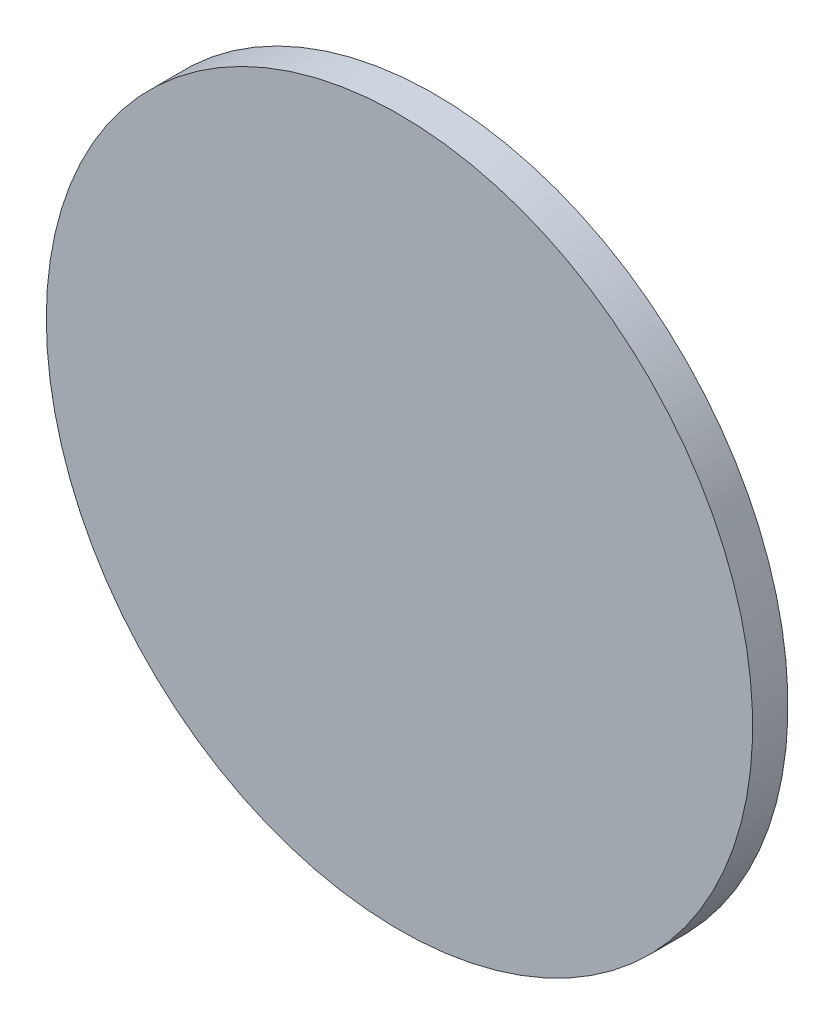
ISO-10303-21;
HEADER;
FILE_DESCRIPTION(('STEP AP214'),'2;1');
FILE_NAME('part.step','',(''),(''),'','','');
FILE_SCHEMA(('AUTOMOTIVE_DESIGN { 1 0 10303 214 1 1 1 1 }'));
ENDSEC;
DATA;
#1=APPLICATION_CONTEXT('core data for automotive mechanical design processes');
#2=APPLICATION_PROTOCOL_DEFINITION('international standard','automotive_design',2000,#1);
#3=PRODUCT_CONTEXT('',#1,'mechanical');
#4=PRODUCT('Part','Part','',(#3));
#5=PRODUCT_RELATED_PRODUCT_CATEGORY('part','',(#4));
#6=PRODUCT_DEFINITION_FORMATION('','',#4);
#7=PRODUCT_DEFINITION_CONTEXT('part definition',#1,'design');
#8=PRODUCT_DEFINITION('design','',#6,#7);
#9=PRODUCT_DEFINITION_SHAPE('','',#8);
#10=(LENGTH_UNIT() NAMED_UNIT(*) SI_UNIT(.MILLI.,.METRE.));
#11=(NAMED_UNIT(*) PLANE_ANGLE_UNIT() SI_UNIT($,.RADIAN.));
#12=(NAMED_UNIT(*) SI_UNIT($,.STERADIAN.) SOLID_ANGLE_UNIT());
#13=UNCERTAINTY_MEASURE_WITH_UNIT(LENGTH_MEASURE(1.E-05),#10,'distance_accuracy_value','');
#14=(GEOMETRIC_REPRESENTATION_CONTEXT(3) GLOBAL_UNCERTAINTY_ASSIGNED_CONTEXT((#13)) GLOBAL_UNIT_ASSIGNED_CONTEXT((#10,
#11,#12)) REPRESENTATION_CONTEXT('',''));
#15=CARTESIAN_POINT('',(0.,0.,0.));
#16=DIRECTION('',(0.,0.,1.));
#17=DIRECTION('',(1.,0.,0.));
#18=AXIS2_PLACEMENT_3D('',#15,#16,#17);
#19=CARTESIAN_POINT('',(640.,-109.,-70.9));
#20=DIRECTION('',(-1.,0.,0.));
#21=DIRECTION('',(0.,0.,1.));
#22=AXIS2_PLACEMENT_3D('',#19,#20,#21);
#23=PLANE('',#22);
#24=DIRECTION('',(0.,0.,1.));
#25=VECTOR('',#24,1.);
#26=CARTESIAN_POINT('',(640.,-108.,-70.9));
#27=LINE('',#26,#25);
#28=CARTESIAN_POINT('',(640.,-108.,-68.9));
#29=VERTEX_POINT('',#28);
#30=CARTESIAN_POINT('',(640.,-108.,-70.4673638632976));
#31=VERTEX_POINT('',#30);
#32=EDGE_CURVE('E68',#29,#31,#27,.F.);
#33=ORIENTED_EDGE('',*,*,#32,.T.);
#34=CARTESIAN_POINT('',(640.,-108.,-70.4673638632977));
#35=CARTESIAN_POINT('',(640.,-108.333333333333,-70.4872656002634));
#36=CARTESIAN_POINT('',(640.,-108.666666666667,-70.4972164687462));
#37=CARTESIAN_POINT('',(640.,-109.333333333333,-70.4972164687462));
#38=CARTESIAN_POINT('',(640.,-109.666666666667,-70.4872656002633));
#39=CARTESIAN_POINT('',(640.,-110.,-70.4673638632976));
#40=B_SPLINE_CURVE_WITH_KNOTS('',3,(#34,#35,#36,#37,#38,#39),.UNSPECIFIED.,.F.,.F.,(4,2,4),(0.,
1.00044548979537,2.00089097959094),.UNSPECIFIED.);
#41=CARTESIAN_POINT('',(640.,-110.,-70.4673638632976));
#42=VERTEX_POINT('',#41);
#43=EDGE_CURVE('E60',#31,#42,#40,.T.);
#44=ORIENTED_EDGE('',*,*,#43,.T.);
#45=DIRECTION('',(0.,0.,1.));
#46=VECTOR('',#45,1.);
#47=CARTESIAN_POINT('',(640.,-110.,-70.9));
#48=LINE('',#47,#46);
#49=CARTESIAN_POINT('',(640.,-110.,-68.9));
#50=VERTEX_POINT('',#49);
#51=EDGE_CURVE('E66',#42,#50,#48,.T.);
#52=ORIENTED_EDGE('',*,*,#51,.T.);
#53=DIRECTION('',(0.,1.,0.));
#54=VECTOR('',#53,1.);
#55=CARTESIAN_POINT('',(640.,-109.,-68.9));
#56=LINE('',#55,#54);
#57=EDGE_CURVE('E137',#29,#50,#56,.F.);
#58=ORIENTED_EDGE('',*,*,#57,.F.);
#59=EDGE_LOOP('',(#33,#44,#52,#58));
#60=FACE_BOUND('',#59,.T.);
#61=ADVANCED_FACE('F16',(#60),#23,.T.);
#62=CARTESIAN_POINT('',(626.,-109.,-70.9));
#63=DIRECTION('',(1.,0.,0.));
#64=DIRECTION('',(0.,0.,-1.));
#65=AXIS2_PLACEMENT_3D('',#62,#63,#64);
#66=PLANE('',#65);
#67=DIRECTION('',(0.,0.,-1.));
#68=VECTOR('',#67,1.);
#69=CARTESIAN_POINT('',(626.,-110.,-70.8999999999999));
#70=LINE('',#69,#68);
#71=CARTESIAN_POINT('',(626.,-110.,-68.9));
#72=VERTEX_POINT('',#71);
#73=CARTESIAN_POINT('',(626.,-110.,-70.4673638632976));
#74=VERTEX_POINT('',#73);
#75=EDGE_CURVE('E150',#72,#74,#70,.T.);
#76=ORIENTED_EDGE('',*,*,#75,.T.);
#77=CARTESIAN_POINT('',(626.,-110.,-70.4673638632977));
#78=CARTESIAN_POINT('',(626.,-109.666666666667,-70.4872656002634));
#79=CARTESIAN_POINT('',(626.,-109.333333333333,-70.4972164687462));
#80=CARTESIAN_POINT('',(626.,-108.666666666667,-70.4972164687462));
#81=CARTESIAN_POINT('',(626.,-108.333333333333,-70.4872656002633));
#82=CARTESIAN_POINT('',(626.,-108.,-70.4673638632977));
#83=B_SPLINE_CURVE_WITH_KNOTS('',3,(#77,#78,#79,#80,#81,#82),.UNSPECIFIED.,.F.,.F.,(4,2,4),(0.,
1.00044548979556,2.00089097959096),.UNSPECIFIED.);
#84=CARTESIAN_POINT('',(626.,-108.,-70.4673638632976));
#85=VERTEX_POINT('',#84);
#86=EDGE_CURVE('E81',#74,#85,#83,.T.);
#87=ORIENTED_EDGE('',*,*,#86,.T.);
#88=DIRECTION('',(0.,0.,-1.));
#89=VECTOR('',#88,1.);
#90=CARTESIAN_POINT('',(626.,-108.,-70.9));
#91=LINE('',#90,#89);
#92=CARTESIAN_POINT('',(626.,-108.,-68.8999999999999));
#93=VERTEX_POINT('',#92);
#94=EDGE_CURVE('E40',#85,#93,#91,.F.);
#95=ORIENTED_EDGE('',*,*,#94,.T.);
#96=DIRECTION('',(0.,1.,0.));
#97=VECTOR('',#96,1.);
#98=CARTESIAN_POINT('',(626.,-109.,-68.9));
#99=LINE('',#98,#97);
#100=EDGE_CURVE('E135',#72,#93,#99,.T.);
#101=ORIENTED_EDGE('',*,*,#100,.F.);
#102=EDGE_LOOP('',(#76,#87,#95,#101));
#103=FACE_BOUND('',#102,.T.);
#104=ADVANCED_FACE('F161',(#103),#66,.T.);
#105=CARTESIAN_POINT('',(633.,-109.,-68.9));
#106=DIRECTION('',(0.,0.,-1.));
#107=DIRECTION('',(-1.,0.,0.));
#108=AXIS2_PLACEMENT_3D('',#105,#106,#107);
#109=PLANE('',#108);
#110=ORIENTED_EDGE('',*,*,#100,.T.);
#111=DIRECTION('',(1.,0.,0.));
#112=VECTOR('',#111,1.);
#113=CARTESIAN_POINT('',(633.,-108.,-68.9));
#114=LINE('',#113,#112);
#115=EDGE_CURVE('E83',#29,#93,#114,.F.);
#116=ORIENTED_EDGE('',*,*,#115,.F.);
#117=ORIENTED_EDGE('',*,*,#57,.T.);
#118=DIRECTION('',(1.,0.,0.));
#119=VECTOR('',#118,1.);
#120=CARTESIAN_POINT('',(633.,-110.,-68.9));
#121=LINE('',#120,#119);
#122=EDGE_CURVE('E77',#72,#50,#121,.T.);
#123=ORIENTED_EDGE('',*,*,#122,.F.);
#124=EDGE_LOOP('',(#110,#116,#117,#123));
#125=FACE_BOUND('',#124,.T.);
#126=ADVANCED_FACE('F106',(#125),#109,.T.);
#127=CARTESIAN_POINT('',(633.,-110.,-70.9));
#128=DIRECTION('',(0.,1.,0.));
#129=DIRECTION('',(0.,0.,1.));
#130=AXIS2_PLACEMENT_3D('',#127,#128,#129);
#131=PLANE('',#130);
#132=ORIENTED_EDGE('',*,*,#122,.T.);
#133=ORIENTED_EDGE('',*,*,#51,.F.);
#134=CARTESIAN_POINT('',(626.,-110.,-70.4673638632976));
#135=CARTESIAN_POINT('',(626.313545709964,-110.,-70.598534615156));
#136=CARTESIAN_POINT('',(626.630784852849,-110.,-70.72087279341));
#137=CARTESIAN_POINT('',(627.27162720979,-110.,-70.9475405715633));
#138=CARTESIAN_POINT('',(627.595230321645,-110.,-71.0518704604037));
#139=CARTESIAN_POINT('',(628.247787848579,-110.,-71.2421824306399));
#140=CARTESIAN_POINT('',(628.576742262,-110.,-71.3281645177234));
#141=CARTESIAN_POINT('',(629.239174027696,-110.,-71.4815620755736));
#142=CARTESIAN_POINT('',(629.572654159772,-110.,-71.5489655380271));
#143=CARTESIAN_POINT('',(630.24287303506,-110.,-71.6649165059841));
#144=CARTESIAN_POINT('',(630.579611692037,-110.,-71.713464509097));
#145=CARTESIAN_POINT('',(631.255251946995,-110.,-71.7915532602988));
#146=CARTESIAN_POINT('',(631.594153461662,-110.,-71.821094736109));
#147=CARTESIAN_POINT('',(632.443158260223,-110.,-71.8710862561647));
#148=CARTESIAN_POINT('',(632.954014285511,-110.,-71.8795769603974));
#149=CARTESIAN_POINT('',(633.974645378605,-110.,-71.8534474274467));
#150=CARTESIAN_POINT('',(634.484420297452,-110.,-71.8188215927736));
#151=CARTESIAN_POINT('',(635.498320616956,-110.,-71.7068091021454));
#152=CARTESIAN_POINT('',(636.002454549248,-110.,-71.6294996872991));
#153=CARTESIAN_POINT('',(637.002225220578,-110.,-71.4327505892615));
#154=CARTESIAN_POINT('',(637.497865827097,-110.,-71.3133306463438));
#155=CARTESIAN_POINT('',(638.329727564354,-110.,-71.0754351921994));
#156=CARTESIAN_POINT('',(638.669004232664,-110.,-70.9675073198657));
#157=CARTESIAN_POINT('',(639.340182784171,-110.,-70.7320461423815));
#158=CARTESIAN_POINT('',(639.672093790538,-110.,-70.604538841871));
#159=CARTESIAN_POINT('',(640.,-110.,-70.4673638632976));
#160=B_SPLINE_CURVE_WITH_KNOTS('',3,(#134,#135,#136,#137,#138,#139,#140,#141,#142,#143,#144,
#145,#146,#147,#148,#149,#150,#151,#152,#153,#154,#155,#156,#157,#158,#159),.UNSPECIFIED.,.F.,
.F.,(4,2,2,2,2,2,2,2,2,2,2,2,4),(0.,1.01949601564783,2.03897567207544,3.05845501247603,
4.07859175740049,5.09870157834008,6.11877233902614,7.64962412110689,9.18067466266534,
10.7089636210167,12.2365371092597,13.3040452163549,14.3701475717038),.UNSPECIFIED.);
#161=EDGE_CURVE('E74',#74,#42,#160,.T.);
#162=ORIENTED_EDGE('',*,*,#161,.F.);
#163=ORIENTED_EDGE('',*,*,#75,.F.);
#164=EDGE_LOOP('',(#132,#133,#162,#163));
#165=FACE_BOUND('',#164,.T.);
#166=ADVANCED_FACE('F72',(#165),#131,.T.);
#167=CARTESIAN_POINT('',(633.,-108.,-70.9));
#168=DIRECTION('',(0.,-1.,0.));
#169=DIRECTION('',(0.,0.,-1.));
#170=AXIS2_PLACEMENT_3D('',#167,#168,#169);
#171=PLANE('',#170);
#172=ORIENTED_EDGE('',*,*,#115,.T.);
#173=ORIENTED_EDGE('',*,*,#94,.F.);
#174=CARTESIAN_POINT('',(640.,-108.,-70.4673638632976));
#175=CARTESIAN_POINT('',(639.686454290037,-108.,-70.5985346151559));
#176=CARTESIAN_POINT('',(639.369215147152,-108.,-70.7208727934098));
#177=CARTESIAN_POINT('',(638.72837279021,-108.,-70.9475405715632));
#178=CARTESIAN_POINT('',(638.404769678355,-108.,-71.0518704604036));
#179=CARTESIAN_POINT('',(637.752212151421,-108.,-71.2421824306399));
#180=CARTESIAN_POINT('',(637.423257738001,-108.,-71.3281645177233));
#181=CARTESIAN_POINT('',(636.760825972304,-108.,-71.4815620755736));
#182=CARTESIAN_POINT('',(636.427345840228,-108.,-71.5489655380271));
#183=CARTESIAN_POINT('',(635.75712696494,-108.,-71.6649165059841));
#184=CARTESIAN_POINT('',(635.420388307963,-108.,-71.7134645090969));
#185=CARTESIAN_POINT('',(634.744748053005,-108.,-71.7915532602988));
#186=CARTESIAN_POINT('',(634.405846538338,-108.,-71.8210947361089));
#187=CARTESIAN_POINT('',(633.556841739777,-108.,-71.8710862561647));
#188=CARTESIAN_POINT('',(633.045985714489,-108.,-71.8795769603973));
#189=CARTESIAN_POINT('',(632.025354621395,-108.,-71.8534474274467));
#190=CARTESIAN_POINT('',(631.515579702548,-108.,-71.8188215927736));
#191=CARTESIAN_POINT('',(630.501679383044,-108.,-71.7068091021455));
#192=CARTESIAN_POINT('',(629.997545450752,-108.,-71.6294996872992));
#193=CARTESIAN_POINT('',(628.997774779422,-108.,-71.4327505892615));
#194=CARTESIAN_POINT('',(628.502134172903,-108.,-71.3133306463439));
#195=CARTESIAN_POINT('',(627.670272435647,-108.,-71.0754351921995));
#196=CARTESIAN_POINT('',(627.330995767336,-108.,-70.9675073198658));
#197=CARTESIAN_POINT('',(626.659817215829,-108.,-70.7320461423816));
#198=CARTESIAN_POINT('',(626.327906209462,-108.,-70.6045388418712));
#199=CARTESIAN_POINT('',(626.,-108.,-70.4673638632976));
#200=B_SPLINE_CURVE_WITH_KNOTS('',3,(#174,#175,#176,#177,#178,#179,#180,#181,#182,#183,#184,
#185,#186,#187,#188,#189,#190,#191,#192,#193,#194,#195,#196,#197,#198,#199),.UNSPECIFIED.,.F.,
.F.,(4,2,2,2,2,2,2,2,2,2,2,2,4),(0.,1.01949601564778,2.03897567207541,3.05845501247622,
4.0785917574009,5.09870157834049,6.11877233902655,7.6496241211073,9.18067466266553,
10.7089636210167,12.2365371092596,13.304045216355,14.3701475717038),.UNSPECIFIED.);
#201=EDGE_CURVE('E82',#31,#85,#200,.T.);
#202=ORIENTED_EDGE('',*,*,#201,.F.);
#203=ORIENTED_EDGE('',*,*,#32,.F.);
#204=EDGE_LOOP('',(#172,#173,#202,#203));
#205=FACE_BOUND('',#204,.T.);
#206=ADVANCED_FACE('F105',(#205),#171,.T.);
#207=CARTESIAN_POINT('',(633.,-109.,-53.7333333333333));
#208=DIRECTION('',(0.192522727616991,0.731996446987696,0.65354127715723));
#209=DIRECTION('',(0.334221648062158,-0.675094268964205,0.657680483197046));
#210=AXIS2_PLACEMENT_3D('',#207,#208,#209);
#211=SPHERICAL_SURFACE('',#210,18.1666666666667);
#212=ORIENTED_EDGE('',*,*,#161,.T.);
#213=ORIENTED_EDGE('',*,*,#43,.F.);
#214=ORIENTED_EDGE('',*,*,#201,.T.);
#215=ORIENTED_EDGE('',*,*,#86,.F.);
#216=EDGE_LOOP('',(#212,#213,#214,#215));
#217=FACE_BOUND('',#216,.T.);
#218=CARTESIAN_POINT('',(633.,-109.,-68.9));
#219=DIRECTION('',(0.,0.,-1.));
#220=DIRECTION('',(-1.,0.,0.));
#221=AXIS2_PLACEMENT_3D('',#218,#219,#220);
#222=CIRCLE('',#221,10.);
#223=CARTESIAN_POINT('',(623.,-109.,-68.9));
#224=VERTEX_POINT('',#223);
#225=EDGE_CURVE('E31',#224,#224,#222,.F.);
#226=ORIENTED_EDGE('',*,*,#225,.F.);
#227=EDGE_LOOP('',(#226));
#228=FACE_BOUND('',#227,.T.);
#229=ADVANCED_FACE('F79',(#217,#228),#211,.T.);
#230=CARTESIAN_POINT('',(633.,-109.,-68.4));
#231=DIRECTION('',(0.,0.,-1.));
#232=DIRECTION('',(-1.,0.,0.));
#233=AXIS2_PLACEMENT_3D('',#230,#231,#232);
#234=CYLINDRICAL_SURFACE('',#233,10.);
#235=ORIENTED_EDGE('',*,*,#225,.T.);
#236=EDGE_LOOP('',(#235));
#237=FACE_BOUND('',#236,.T.);
#238=CARTESIAN_POINT('',(633.,-109.,-67.9));
#239=DIRECTION('',(0.,0.,-1.));
#240=DIRECTION('',(-1.,0.,0.));
#241=AXIS2_PLACEMENT_3D('',#238,#239,#240);
#242=CIRCLE('',#241,10.);
#243=CARTESIAN_POINT('',(623.,-109.,-67.9));
#244=VERTEX_POINT('',#243);
#245=EDGE_CURVE('E11',#244,#244,#242,.F.);
#246=ORIENTED_EDGE('',*,*,#245,.F.);
#247=EDGE_LOOP('',(#246));
#248=FACE_BOUND('',#247,.T.);
#249=ADVANCED_FACE('F115',(#237,#248),#234,.T.);
#250=CARTESIAN_POINT('',(638.,-109.,-67.9));
#251=DIRECTION('',(0.,0.,1.));
#252=DIRECTION('',(1.,0.,0.));
#253=AXIS2_PLACEMENT_3D('',#250,#251,#252);
#254=PLANE('',#253);
#255=ORIENTED_EDGE('',*,*,#245,.T.);
#256=EDGE_LOOP('',(#255));
#257=FACE_BOUND('',#256,.T.);
#258=ADVANCED_FACE('F18',(#257),#254,.T.);
#259=CLOSED_SHELL('',(#61,#104,#126,#166,#206,#229,#249,#258));
#260=MANIFOLD_SOLID_BREP('B1',#259);
#261=ADVANCED_BREP_SHAPE_REPRESENTATION('',(#18,#260),#14);
#262=SHAPE_DEFINITION_REPRESENTATION(#9,#261);
ENDSEC;
END-ISO-10303-21;
